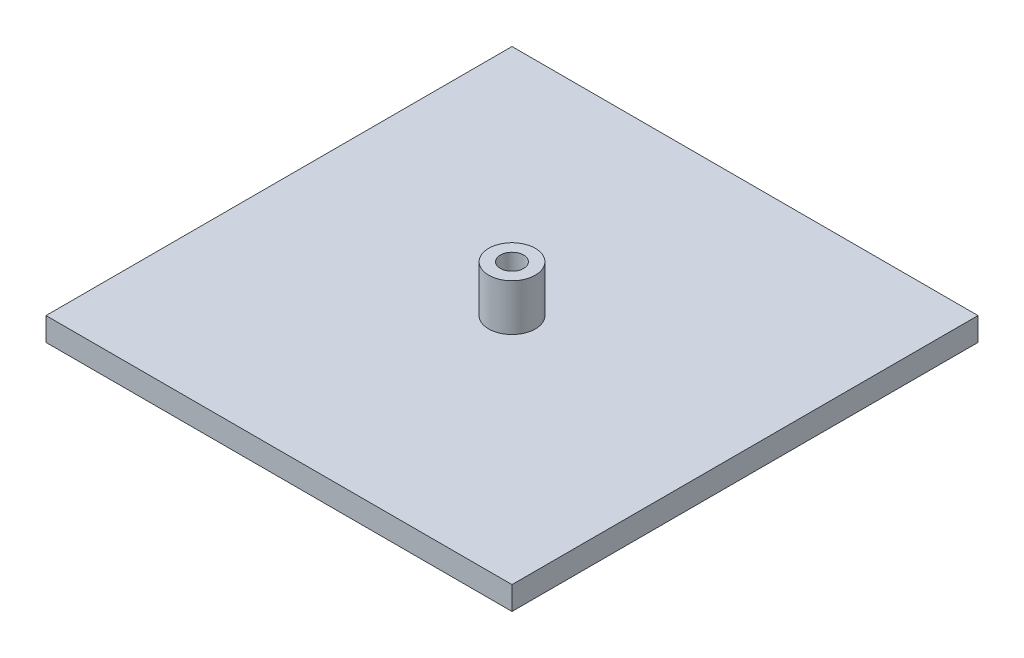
from build123d import *

# Parameters (mm, degrees)
ESQUISSE1_W        = 20
ESQUISSE1_H        = 20
ESQUISSE1_R        = 0.5
BOSS_EXTRU_1_DEPTH = 1
ESQUISSE2_R        = 1
ESQUISSE2_R_2      = 0.5
BOSS_EXTRU_2_DEPTH = 2


with BuildPart() as part:
    # Esquisse1 → Boss.-Extru.1 (new body)
    with BuildSketch(Plane(origin=(0, 0, 0), x_dir=(1, 0, 0), z_dir=(0, 1, 0))):
        Rectangle(ESQUISSE1_W, ESQUISSE1_H)
        with Locations(Location((0, 0, 0), (0, 0, 270))):
            Circle(ESQUISSE1_R, mode=Mode.SUBTRACT)
    extrude(amount=BOSS_EXTRU_1_DEPTH)

    # Esquisse2 → Boss.-Extru.2 (add)
    with BuildSketch(Plane(origin=(0, 1, 0), x_dir=(1, 0, 0), z_dir=(0, 1, 0))):
        with Locations(Location((0, 0, 0), (0, 0, 90))):
            Circle(ESQUISSE2_R)
        with Locations(Location((0, 0, 0), (0, 0, 270))):
            Circle(ESQUISSE2_R_2, mode=Mode.SUBTRACT)
    extrude(amount=BOSS_EXTRU_2_DEPTH)


solid = part.part
